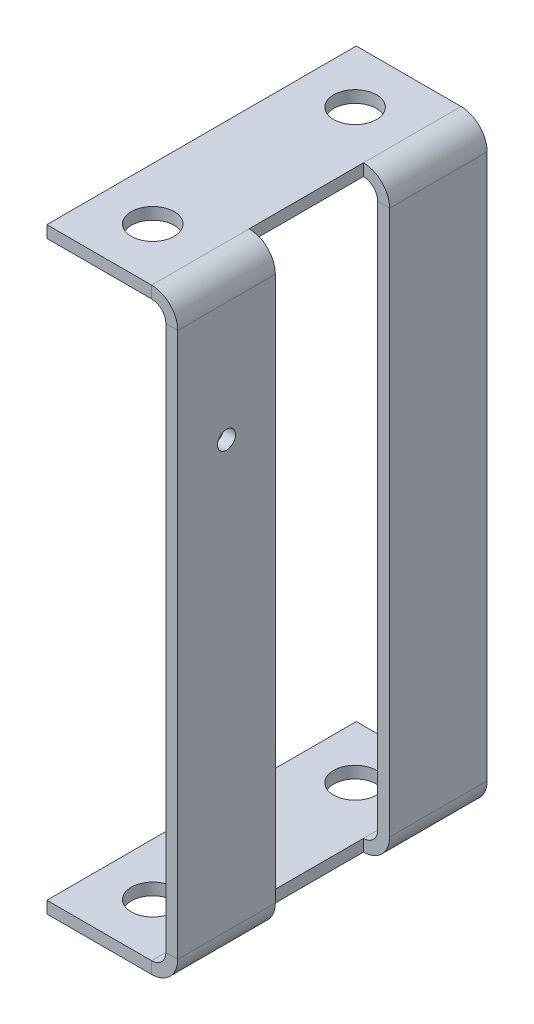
ISO-10303-21;
HEADER;
FILE_DESCRIPTION(('STEP AP214'),'2;1');
FILE_NAME('part.step','',(''),(''),'','','');
FILE_SCHEMA(('AUTOMOTIVE_DESIGN { 1 0 10303 214 1 1 1 1 }'));
ENDSEC;
DATA;
#1=APPLICATION_CONTEXT('core data for automotive mechanical design processes');
#2=APPLICATION_PROTOCOL_DEFINITION('international standard','automotive_design',2000,#1);
#3=PRODUCT_CONTEXT('',#1,'mechanical');
#4=PRODUCT('Part','Part','',(#3));
#5=PRODUCT_RELATED_PRODUCT_CATEGORY('part','',(#4));
#6=PRODUCT_DEFINITION_FORMATION('','',#4);
#7=PRODUCT_DEFINITION_CONTEXT('part definition',#1,'design');
#8=PRODUCT_DEFINITION('design','',#6,#7);
#9=PRODUCT_DEFINITION_SHAPE('','',#8);
#10=(LENGTH_UNIT() NAMED_UNIT(*) SI_UNIT(.MILLI.,.METRE.));
#11=(NAMED_UNIT(*) PLANE_ANGLE_UNIT() SI_UNIT($,.RADIAN.));
#12=(NAMED_UNIT(*) SI_UNIT($,.STERADIAN.) SOLID_ANGLE_UNIT());
#13=UNCERTAINTY_MEASURE_WITH_UNIT(LENGTH_MEASURE(1.E-05),#10,'distance_accuracy_value','');
#14=(GEOMETRIC_REPRESENTATION_CONTEXT(3) GLOBAL_UNCERTAINTY_ASSIGNED_CONTEXT((#13)) GLOBAL_UNIT_ASSIGNED_CONTEXT((#10,
#11,#12)) REPRESENTATION_CONTEXT('',''));
#15=CARTESIAN_POINT('',(0.,0.,0.));
#16=DIRECTION('',(0.,0.,1.));
#17=DIRECTION('',(1.,0.,0.));
#18=AXIS2_PLACEMENT_3D('',#15,#16,#17);
#19=CARTESIAN_POINT('',(1.39700000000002,-11.2436076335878,0.795931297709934));
#20=DIRECTION('',(0.,0.,-1.));
#21=DIRECTION('',(-1.,0.,0.));
#22=AXIS2_PLACEMENT_3D('',#19,#20,#21);
#23=PLANE('',#22);
#24=DIRECTION('',(0.,1.,0.));
#25=VECTOR('',#24,1.);
#26=CARTESIAN_POINT('',(0.,0.,0.795931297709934));
#27=LINE('',#26,#25);
#28=CARTESIAN_POINT('',(0.,-9.84660763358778,0.795931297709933));
#29=VERTEX_POINT('',#28);
#30=CARTESIAN_POINT('',(0.,19.2089923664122,0.795931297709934));
#31=VERTEX_POINT('',#30);
#32=EDGE_CURVE('E251',#29,#31,#27,.T.);
#33=ORIENTED_EDGE('',*,*,#32,.T.);
#34=DIRECTION('',(-1.,0.,0.));
#35=VECTOR('',#34,1.);
#36=CARTESIAN_POINT('',(0.,19.2089923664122,0.795931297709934));
#37=LINE('',#36,#35);
#38=CARTESIAN_POINT('',(-0.635,19.2089923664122,0.795931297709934));
#39=VERTEX_POINT('',#38);
#40=EDGE_CURVE('E15',#31,#39,#37,.T.);
#41=ORIENTED_EDGE('',*,*,#40,.T.);
#42=DIRECTION('',(0.,1.,0.));
#43=VECTOR('',#42,1.);
#44=CARTESIAN_POINT('',(-0.635,0.,0.795931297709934));
#45=LINE('',#44,#43);
#46=CARTESIAN_POINT('',(-0.634999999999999,-9.84660763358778,0.795931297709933));
#47=VERTEX_POINT('',#46);
#48=EDGE_CURVE('E411',#47,#39,#45,.T.);
#49=ORIENTED_EDGE('',*,*,#48,.F.);
#50=CARTESIAN_POINT('',(-1.397,-9.84660763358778,0.795931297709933));
#51=DIRECTION('',(0.,0.,-1.));
#52=DIRECTION('',(-1.,0.,0.));
#53=AXIS2_PLACEMENT_3D('',#50,#51,#52);
#54=CIRCLE('',#53,0.762000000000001);
#55=CARTESIAN_POINT('',(-1.397,-10.6086076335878,0.795931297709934));
#56=VERTEX_POINT('',#55);
#57=EDGE_CURVE('E99',#56,#47,#54,.F.);
#58=ORIENTED_EDGE('',*,*,#57,.F.);
#59=DIRECTION('',(0.,1.,0.));
#60=VECTOR('',#59,1.);
#61=CARTESIAN_POINT('',(-1.39700000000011,-11.2436076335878,0.795931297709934));
#62=LINE('',#61,#60);
#63=CARTESIAN_POINT('',(-1.39700000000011,-11.2436076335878,0.795931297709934));
#64=VERTEX_POINT('',#63);
#65=EDGE_CURVE('E112',#64,#56,#62,.T.);
#66=ORIENTED_EDGE('',*,*,#65,.F.);
#67=CARTESIAN_POINT('',(-1.397,-9.84660763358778,0.795931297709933));
#68=DIRECTION('',(0.,0.,-1.));
#69=DIRECTION('',(-1.,0.,0.));
#70=AXIS2_PLACEMENT_3D('',#67,#68,#69);
#71=CIRCLE('',#70,1.397);
#72=EDGE_CURVE('E227',#64,#29,#71,.F.);
#73=ORIENTED_EDGE('',*,*,#72,.T.);
#74=EDGE_LOOP('',(#33,#41,#49,#58,#66,#73));
#75=FACE_BOUND('',#74,.T.);
#76=ADVANCED_FACE('F90',(#75),#23,.F.);
#77=CARTESIAN_POINT('',(-0.635,0.,0.));
#78=DIRECTION('',(1.,0.,0.));
#79=DIRECTION('',(0.,0.,-1.));
#80=AXIS2_PLACEMENT_3D('',#77,#78,#79);
#81=PLANE('',#80);
#82=DIRECTION('',(0.,0.,1.));
#83=VECTOR('',#82,1.);
#84=CARTESIAN_POINT('',(-0.634999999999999,-9.84660763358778,12.0989312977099));
#85=LINE('',#84,#83);
#86=CARTESIAN_POINT('',(-0.634999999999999,-9.84660763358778,-4.41106870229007));
#87=VERTEX_POINT('',#86);
#88=EDGE_CURVE('E291',#47,#87,#85,.F.);
#89=ORIENTED_EDGE('',*,*,#88,.F.);
#90=ORIENTED_EDGE('',*,*,#48,.T.);
#91=DIRECTION('',(0.,0.,-1.));
#92=VECTOR('',#91,1.);
#93=CARTESIAN_POINT('',(-0.635000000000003,19.2089923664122,-4.41106870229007));
#94=LINE('',#93,#92);
#95=CARTESIAN_POINT('',(-0.635000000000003,19.2089923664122,-4.41106870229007));
#96=VERTEX_POINT('',#95);
#97=EDGE_CURVE('E350',#96,#39,#94,.F.);
#98=ORIENTED_EDGE('',*,*,#97,.F.);
#99=DIRECTION('',(0.,1.,0.));
#100=VECTOR('',#99,1.);
#101=CARTESIAN_POINT('',(-0.635,20.6059923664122,-4.41106870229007));
#102=LINE('',#101,#100);
#103=EDGE_CURVE('E365',#87,#96,#102,.T.);
#104=ORIENTED_EDGE('',*,*,#103,.F.);
#105=EDGE_LOOP('',(#89,#90,#98,#104));
#106=FACE_BOUND('',#105,.T.);
#107=ADVANCED_FACE('F517',(#106),#81,.F.);
#108=CARTESIAN_POINT('',(0.,0.,0.));
#109=DIRECTION('',(1.,0.,0.));
#110=DIRECTION('',(0.,0.,-1.));
#111=AXIS2_PLACEMENT_3D('',#108,#109,#110);
#112=PLANE('',#111);
#113=ORIENTED_EDGE('',*,*,#32,.F.);
#114=DIRECTION('',(0.,0.,1.));
#115=VECTOR('',#114,1.);
#116=CARTESIAN_POINT('',(0.,-9.84660763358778,12.0989312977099));
#117=LINE('',#116,#115);
#118=CARTESIAN_POINT('',(0.,-9.84660763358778,-4.41106870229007));
#119=VERTEX_POINT('',#118);
#120=EDGE_CURVE('E250',#29,#119,#117,.F.);
#121=ORIENTED_EDGE('',*,*,#120,.T.);
#122=DIRECTION('',(0.,1.,0.));
#123=VECTOR('',#122,1.);
#124=CARTESIAN_POINT('',(0.,20.6059923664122,-4.41106870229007));
#125=LINE('',#124,#123);
#126=CARTESIAN_POINT('',(0.,19.2089923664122,-4.41106870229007));
#127=VERTEX_POINT('',#126);
#128=EDGE_CURVE('E366',#119,#127,#125,.T.);
#129=ORIENTED_EDGE('',*,*,#128,.T.);
#130=DIRECTION('',(0.,0.,-1.));
#131=VECTOR('',#130,1.);
#132=CARTESIAN_POINT('',(0.,19.2089923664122,-4.41106870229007));
#133=LINE('',#132,#131);
#134=EDGE_CURVE('E336',#127,#31,#133,.F.);
#135=ORIENTED_EDGE('',*,*,#134,.T.);
#136=EDGE_LOOP('',(#113,#121,#129,#135));
#137=FACE_BOUND('',#136,.T.);
#138=ADVANCED_FACE('F501',(#137),#112,.T.);
#139=CARTESIAN_POINT('',(-1.397,19.2089923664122,-4.41106870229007));
#140=DIRECTION('',(0.,0.,-1.));
#141=DIRECTION('',(0.,1.,0.));
#142=AXIS2_PLACEMENT_3D('',#139,#140,#141);
#143=CYLINDRICAL_SURFACE('',#142,1.397);
#144=CARTESIAN_POINT('',(-1.397,19.2089923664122,0.795931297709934));
#145=DIRECTION('',(0.,0.,-1.));
#146=DIRECTION('',(-1.,0.,0.));
#147=AXIS2_PLACEMENT_3D('',#144,#145,#146);
#148=CIRCLE('',#147,1.397);
#149=CARTESIAN_POINT('',(-1.397,20.6059923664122,0.795931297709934));
#150=VERTEX_POINT('',#149);
#151=EDGE_CURVE('E275',#31,#150,#148,.F.);
#152=ORIENTED_EDGE('',*,*,#151,.F.);
#153=ORIENTED_EDGE('',*,*,#134,.F.);
#154=CARTESIAN_POINT('',(-1.397,19.2089923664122,-4.41106870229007));
#155=DIRECTION('',(0.,0.,-1.));
#156=DIRECTION('',(-1.,0.,0.));
#157=AXIS2_PLACEMENT_3D('',#154,#155,#156);
#158=CIRCLE('',#157,1.397);
#159=CARTESIAN_POINT('',(-1.397,20.6059923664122,-4.41106870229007));
#160=VERTEX_POINT('',#159);
#161=EDGE_CURVE('E344',#160,#127,#158,.T.);
#162=ORIENTED_EDGE('',*,*,#161,.F.);
#163=DIRECTION('',(0.,0.,-1.));
#164=VECTOR('',#163,1.);
#165=CARTESIAN_POINT('',(-1.397,20.6059923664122,12.0989312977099));
#166=LINE('',#165,#164);
#167=EDGE_CURVE('E323',#160,#150,#166,.F.);
#168=ORIENTED_EDGE('',*,*,#167,.T.);
#169=EDGE_LOOP('',(#152,#153,#162,#168));
#170=FACE_BOUND('',#169,.T.);
#171=ADVANCED_FACE('F499',(#170),#143,.T.);
#172=CARTESIAN_POINT('',(-1.397,19.2089923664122,-4.41106870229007));
#173=DIRECTION('',(0.,0.,-1.));
#174=DIRECTION('',(0.,1.,0.));
#175=AXIS2_PLACEMENT_3D('',#172,#173,#174);
#176=CYLINDRICAL_SURFACE('',#175,0.761999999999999);
#177=ORIENTED_EDGE('',*,*,#97,.T.);
#178=CARTESIAN_POINT('',(-1.397,19.2089923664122,0.795931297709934));
#179=DIRECTION('',(0.,0.,-1.));
#180=DIRECTION('',(-1.,0.,0.));
#181=AXIS2_PLACEMENT_3D('',#178,#179,#180);
#182=CIRCLE('',#181,0.761999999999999);
#183=CARTESIAN_POINT('',(-1.397,19.9709923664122,0.795931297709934));
#184=VERTEX_POINT('',#183);
#185=EDGE_CURVE('E252',#39,#184,#182,.F.);
#186=ORIENTED_EDGE('',*,*,#185,.T.);
#187=DIRECTION('',(0.,0.,-1.));
#188=VECTOR('',#187,1.);
#189=CARTESIAN_POINT('',(-1.397,19.9709923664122,12.0989312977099));
#190=LINE('',#189,#188);
#191=CARTESIAN_POINT('',(-1.397,19.9709923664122,-4.41106870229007));
#192=VERTEX_POINT('',#191);
#193=EDGE_CURVE('E333',#184,#192,#190,.T.);
#194=ORIENTED_EDGE('',*,*,#193,.T.);
#195=CARTESIAN_POINT('',(-1.397,19.2089923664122,-4.41106870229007));
#196=DIRECTION('',(0.,0.,-1.));
#197=DIRECTION('',(-1.,0.,0.));
#198=AXIS2_PLACEMENT_3D('',#195,#196,#197);
#199=CIRCLE('',#198,0.761999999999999);
#200=EDGE_CURVE('E305',#192,#96,#199,.T.);
#201=ORIENTED_EDGE('',*,*,#200,.T.);
#202=EDGE_LOOP('',(#177,#186,#194,#201));
#203=FACE_BOUND('',#202,.T.);
#204=ADVANCED_FACE('F509',(#203),#176,.F.);
#205=CARTESIAN_POINT('',(-1.397,-9.84660763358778,12.0989312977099));
#206=DIRECTION('',(0.,0.,1.));
#207=DIRECTION('',(0.,-1.,0.));
#208=AXIS2_PLACEMENT_3D('',#205,#206,#207);
#209=CYLINDRICAL_SURFACE('',#208,1.397);
#210=ORIENTED_EDGE('',*,*,#72,.F.);
#211=DIRECTION('',(0.,0.,1.));
#212=VECTOR('',#211,1.);
#213=CARTESIAN_POINT('',(-1.397,-11.2436076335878,-4.41106870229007));
#214=LINE('',#213,#212);
#215=CARTESIAN_POINT('',(-1.39699999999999,-11.2436076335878,-4.41106870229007));
#216=VERTEX_POINT('',#215);
#217=EDGE_CURVE('E248',#64,#216,#214,.F.);
#218=ORIENTED_EDGE('',*,*,#217,.T.);
#219=CARTESIAN_POINT('',(-1.397,-9.84660763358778,-4.41106870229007));
#220=DIRECTION('',(0.,0.,1.));
#221=DIRECTION('',(1.,0.,0.));
#222=AXIS2_PLACEMENT_3D('',#219,#220,#221);
#223=CIRCLE('',#222,1.397);
#224=EDGE_CURVE('E279',#119,#216,#223,.F.);
#225=ORIENTED_EDGE('',*,*,#224,.F.);
#226=ORIENTED_EDGE('',*,*,#120,.F.);
#227=EDGE_LOOP('',(#210,#218,#225,#226));
#228=FACE_BOUND('',#227,.T.);
#229=ADVANCED_FACE('F246',(#228),#209,.T.);
#230=CARTESIAN_POINT('',(-1.397,-9.84660763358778,12.0989312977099));
#231=DIRECTION('',(0.,0.,1.));
#232=DIRECTION('',(0.,-1.,0.));
#233=AXIS2_PLACEMENT_3D('',#230,#231,#232);
#234=CYLINDRICAL_SURFACE('',#233,0.762000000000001);
#235=DIRECTION('',(0.,0.,1.));
#236=VECTOR('',#235,1.);
#237=CARTESIAN_POINT('',(-1.397,-10.6086076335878,-4.41106870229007));
#238=LINE('',#237,#236);
#239=CARTESIAN_POINT('',(-1.397,-10.6086076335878,-4.41106870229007));
#240=VERTEX_POINT('',#239);
#241=EDGE_CURVE('E263',#240,#56,#238,.T.);
#242=ORIENTED_EDGE('',*,*,#241,.T.);
#243=ORIENTED_EDGE('',*,*,#57,.T.);
#244=ORIENTED_EDGE('',*,*,#88,.T.);
#245=CARTESIAN_POINT('',(-1.397,-9.84660763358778,-4.41106870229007));
#246=DIRECTION('',(0.,0.,1.));
#247=DIRECTION('',(1.,0.,0.));
#248=AXIS2_PLACEMENT_3D('',#245,#246,#247);
#249=CIRCLE('',#248,0.762000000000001);
#250=EDGE_CURVE('E285',#87,#240,#249,.F.);
#251=ORIENTED_EDGE('',*,*,#250,.T.);
#252=EDGE_LOOP('',(#242,#243,#244,#251));
#253=FACE_BOUND('',#252,.T.);
#254=ADVANCED_FACE('F519',(#253),#234,.F.);
#255=CARTESIAN_POINT('',(-0.635,12.8589923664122,9.49543129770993));
#256=DIRECTION('',(1.,0.,0.));
#257=DIRECTION('',(0.,0.,-1.));
#258=AXIS2_PLACEMENT_3D('',#255,#256,#257);
#259=CIRCLE('',#258,0.482599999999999);
#260=CARTESIAN_POINT('',(-0.635,12.8589923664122,9.01283129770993));
#261=VERTEX_POINT('',#260);
#262=EDGE_CURVE('E635',#261,#261,#259,.T.);
#263=ORIENTED_EDGE('',*,*,#262,.T.);
#264=EDGE_LOOP('',(#263));
#265=FACE_BOUND('',#264,.T.);
#266=CARTESIAN_POINT('',(-0.635,19.2089923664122,6.89193129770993));
#267=VERTEX_POINT('',#266);
#268=CARTESIAN_POINT('',(-0.635000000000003,19.2089923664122,12.0989312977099));
#269=VERTEX_POINT('',#268);
#270=EDGE_CURVE('E353',#267,#269,#94,.F.);
#271=ORIENTED_EDGE('',*,*,#270,.F.);
#272=DIRECTION('',(0.,-1.,0.));
#273=VECTOR('',#272,1.);
#274=CARTESIAN_POINT('',(-0.635,0.,6.89193129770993));
#275=LINE('',#274,#273);
#276=CARTESIAN_POINT('',(-0.634999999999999,-9.84660763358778,6.89193129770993));
#277=VERTEX_POINT('',#276);
#278=EDGE_CURVE('E399',#267,#277,#275,.T.);
#279=ORIENTED_EDGE('',*,*,#278,.T.);
#280=CARTESIAN_POINT('',(-0.634999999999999,-9.84660763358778,12.0989312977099));
#281=VERTEX_POINT('',#280);
#282=EDGE_CURVE('E288',#281,#277,#85,.F.);
#283=ORIENTED_EDGE('',*,*,#282,.F.);
#284=DIRECTION('',(0.,-1.,0.));
#285=VECTOR('',#284,1.);
#286=CARTESIAN_POINT('',(-0.635,20.6059923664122,12.0989312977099));
#287=LINE('',#286,#285);
#288=EDGE_CURVE('E362',#269,#281,#287,.T.);
#289=ORIENTED_EDGE('',*,*,#288,.F.);
#290=EDGE_LOOP('',(#271,#279,#283,#289));
#291=FACE_BOUND('',#290,.T.);
#292=ADVANCED_FACE('F459',(#265,#291),#81,.F.);
#293=CARTESIAN_POINT('',(0.,12.8589923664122,9.49543129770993));
#294=DIRECTION('',(1.,0.,0.));
#295=DIRECTION('',(0.,0.,-1.));
#296=AXIS2_PLACEMENT_3D('',#293,#294,#295);
#297=CIRCLE('',#296,0.482599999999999);
#298=CARTESIAN_POINT('',(0.,12.8589923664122,9.01283129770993));
#299=VERTEX_POINT('',#298);
#300=EDGE_CURVE('E632',#299,#299,#297,.T.);
#301=ORIENTED_EDGE('',*,*,#300,.F.);
#302=EDGE_LOOP('',(#301));
#303=FACE_BOUND('',#302,.T.);
#304=DIRECTION('',(0.,-1.,0.));
#305=VECTOR('',#304,1.);
#306=CARTESIAN_POINT('',(0.,0.,6.89193129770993));
#307=LINE('',#306,#305);
#308=CARTESIAN_POINT('',(0.,19.2089923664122,6.89193129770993));
#309=VERTEX_POINT('',#308);
#310=CARTESIAN_POINT('',(0.,-9.84660763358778,6.89193129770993));
#311=VERTEX_POINT('',#310);
#312=EDGE_CURVE('E407',#309,#311,#307,.T.);
#313=ORIENTED_EDGE('',*,*,#312,.F.);
#314=CARTESIAN_POINT('',(0.,19.2089923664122,12.0989312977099));
#315=VERTEX_POINT('',#314);
#316=EDGE_CURVE('E340',#309,#315,#133,.F.);
#317=ORIENTED_EDGE('',*,*,#316,.T.);
#318=DIRECTION('',(0.,-1.,0.));
#319=VECTOR('',#318,1.);
#320=CARTESIAN_POINT('',(0.,20.6059923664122,12.0989312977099));
#321=LINE('',#320,#319);
#322=CARTESIAN_POINT('',(0.,-9.84660763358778,12.0989312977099));
#323=VERTEX_POINT('',#322);
#324=EDGE_CURVE('E359',#315,#323,#321,.T.);
#325=ORIENTED_EDGE('',*,*,#324,.T.);
#326=EDGE_CURVE('E276',#323,#311,#117,.F.);
#327=ORIENTED_EDGE('',*,*,#326,.T.);
#328=EDGE_LOOP('',(#313,#317,#325,#327));
#329=FACE_BOUND('',#328,.T.);
#330=ADVANCED_FACE('F569',(#303,#329),#112,.T.);
#331=CARTESIAN_POINT('',(-0.635,20.6059923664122,12.0989312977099));
#332=DIRECTION('',(0.,0.,1.));
#333=DIRECTION('',(0.,-1.,0.));
#334=AXIS2_PLACEMENT_3D('',#331,#332,#333);
#335=PLANE('',#334);
#336=ORIENTED_EDGE('',*,*,#288,.T.);
#337=DIRECTION('',(1.,0.,0.));
#338=VECTOR('',#337,1.);
#339=CARTESIAN_POINT('',(-0.634999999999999,-9.84660763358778,12.0989312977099));
#340=LINE('',#339,#338);
#341=EDGE_CURVE('E281',#281,#323,#340,.T.);
#342=ORIENTED_EDGE('',*,*,#341,.T.);
#343=ORIENTED_EDGE('',*,*,#324,.F.);
#344=DIRECTION('',(1.,0.,0.));
#345=VECTOR('',#344,1.);
#346=CARTESIAN_POINT('',(-0.635000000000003,19.2089923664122,12.0989312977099));
#347=LINE('',#346,#345);
#348=EDGE_CURVE('E356',#269,#315,#347,.T.);
#349=ORIENTED_EDGE('',*,*,#348,.F.);
#350=EDGE_LOOP('',(#336,#342,#343,#349));
#351=FACE_BOUND('',#350,.T.);
#352=ADVANCED_FACE('F92',(#351),#335,.T.);
#353=CARTESIAN_POINT('',(-0.635,20.6059923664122,-4.41106870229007));
#354=DIRECTION('',(0.,0.,-1.));
#355=DIRECTION('',(0.,1.,0.));
#356=AXIS2_PLACEMENT_3D('',#353,#354,#355);
#357=PLANE('',#356);
#358=DIRECTION('',(1.,0.,0.));
#359=VECTOR('',#358,1.);
#360=CARTESIAN_POINT('',(-0.634999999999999,-9.84660763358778,-4.41106870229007));
#361=LINE('',#360,#359);
#362=EDGE_CURVE('E296',#87,#119,#361,.T.);
#363=ORIENTED_EDGE('',*,*,#362,.F.);
#364=ORIENTED_EDGE('',*,*,#103,.T.);
#365=DIRECTION('',(1.,0.,0.));
#366=VECTOR('',#365,1.);
#367=CARTESIAN_POINT('',(-0.635000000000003,19.2089923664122,-4.41106870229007));
#368=LINE('',#367,#366);
#369=EDGE_CURVE('E343',#96,#127,#368,.T.);
#370=ORIENTED_EDGE('',*,*,#369,.T.);
#371=ORIENTED_EDGE('',*,*,#128,.F.);
#372=EDGE_LOOP('',(#363,#364,#370,#371));
#373=FACE_BOUND('',#372,.T.);
#374=ADVANCED_FACE('F505',(#373),#357,.T.);
#375=CARTESIAN_POINT('',(-1.397,19.2089923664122,12.0989312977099));
#376=DIRECTION('',(0.,0.,1.));
#377=DIRECTION('',(1.,0.,0.));
#378=AXIS2_PLACEMENT_3D('',#375,#376,#377);
#379=PLANE('',#378);
#380=DIRECTION('',(0.,-1.,0.));
#381=VECTOR('',#380,1.);
#382=CARTESIAN_POINT('',(-1.397,20.6059923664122,12.0989312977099));
#383=LINE('',#382,#381);
#384=CARTESIAN_POINT('',(-1.397,19.9709923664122,12.0989312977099));
#385=VERTEX_POINT('',#384);
#386=CARTESIAN_POINT('',(-1.397,20.6059923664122,12.0989312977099));
#387=VERTEX_POINT('',#386);
#388=EDGE_CURVE('E299',#385,#387,#383,.F.);
#389=ORIENTED_EDGE('',*,*,#388,.F.);
#390=CARTESIAN_POINT('',(-1.397,19.2089923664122,12.0989312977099));
#391=DIRECTION('',(0.,0.,-1.));
#392=DIRECTION('',(-1.,0.,0.));
#393=AXIS2_PLACEMENT_3D('',#390,#391,#392);
#394=CIRCLE('',#393,0.761999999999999);
#395=EDGE_CURVE('E347',#269,#385,#394,.F.);
#396=ORIENTED_EDGE('',*,*,#395,.F.);
#397=ORIENTED_EDGE('',*,*,#348,.T.);
#398=CARTESIAN_POINT('',(-1.397,19.2089923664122,12.0989312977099));
#399=DIRECTION('',(0.,0.,-1.));
#400=DIRECTION('',(-1.,0.,0.));
#401=AXIS2_PLACEMENT_3D('',#398,#399,#400);
#402=CIRCLE('',#401,1.397);
#403=EDGE_CURVE('E339',#315,#387,#402,.F.);
#404=ORIENTED_EDGE('',*,*,#403,.T.);
#405=EDGE_LOOP('',(#389,#396,#397,#404));
#406=FACE_BOUND('',#405,.T.);
#407=ADVANCED_FACE('F465',(#406),#379,.T.);
#408=CARTESIAN_POINT('',(-1.397,19.2089923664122,-4.41106870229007));
#409=DIRECTION('',(0.,0.,1.));
#410=DIRECTION('',(1.,0.,0.));
#411=AXIS2_PLACEMENT_3D('',#408,#409,#410);
#412=PLANE('',#411);
#413=ORIENTED_EDGE('',*,*,#200,.F.);
#414=DIRECTION('',(0.,-1.,0.));
#415=VECTOR('',#414,1.);
#416=CARTESIAN_POINT('',(-1.397,19.9709923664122,-4.41106870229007));
#417=LINE('',#416,#415);
#418=EDGE_CURVE('E327',#192,#160,#417,.F.);
#419=ORIENTED_EDGE('',*,*,#418,.T.);
#420=ORIENTED_EDGE('',*,*,#161,.T.);
#421=ORIENTED_EDGE('',*,*,#369,.F.);
#422=EDGE_LOOP('',(#413,#419,#420,#421));
#423=FACE_BOUND('',#422,.T.);
#424=ADVANCED_FACE('F492',(#423),#412,.F.);
#425=CARTESIAN_POINT('',(-1.397,19.2089923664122,6.89193129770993));
#426=DIRECTION('',(0.,0.,1.));
#427=DIRECTION('',(1.,0.,0.));
#428=AXIS2_PLACEMENT_3D('',#425,#426,#427);
#429=CIRCLE('',#428,1.397);
#430=CARTESIAN_POINT('',(-1.397,20.6059923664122,6.89193129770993));
#431=VERTEX_POINT('',#430);
#432=EDGE_CURVE('E409',#431,#309,#429,.F.);
#433=ORIENTED_EDGE('',*,*,#432,.F.);
#434=EDGE_CURVE('E326',#431,#387,#166,.F.);
#435=ORIENTED_EDGE('',*,*,#434,.T.);
#436=ORIENTED_EDGE('',*,*,#403,.F.);
#437=ORIENTED_EDGE('',*,*,#316,.F.);
#438=EDGE_LOOP('',(#433,#435,#436,#437));
#439=FACE_BOUND('',#438,.T.);
#440=ADVANCED_FACE('F579',(#439),#143,.T.);
#441=CARTESIAN_POINT('',(-1.397,19.9709923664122,6.89193129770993));
#442=VERTEX_POINT('',#441);
#443=EDGE_CURVE('E330',#385,#442,#190,.T.);
#444=ORIENTED_EDGE('',*,*,#443,.T.);
#445=CARTESIAN_POINT('',(-1.397,19.2089923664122,6.89193129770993));
#446=DIRECTION('',(0.,0.,1.));
#447=DIRECTION('',(1.,0.,0.));
#448=AXIS2_PLACEMENT_3D('',#445,#446,#447);
#449=CIRCLE('',#448,0.761999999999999);
#450=EDGE_CURVE('E402',#442,#267,#449,.F.);
#451=ORIENTED_EDGE('',*,*,#450,.T.);
#452=ORIENTED_EDGE('',*,*,#270,.T.);
#453=ORIENTED_EDGE('',*,*,#395,.T.);
#454=EDGE_LOOP('',(#444,#451,#452,#453));
#455=FACE_BOUND('',#454,.T.);
#456=ADVANCED_FACE('F469',(#455),#176,.F.);
#457=CARTESIAN_POINT('',(-6.985,20.6059923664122,-4.41106870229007));
#458=DIRECTION('',(0.,0.,1.));
#459=DIRECTION('',(1.,0.,0.));
#460=AXIS2_PLACEMENT_3D('',#457,#458,#459);
#461=PLANE('',#460);
#462=ORIENTED_EDGE('',*,*,#418,.F.);
#463=DIRECTION('',(1.,0.,0.));
#464=VECTOR('',#463,1.);
#465=CARTESIAN_POINT('',(-6.985,19.9709923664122,-4.41106870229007));
#466=LINE('',#465,#464);
#467=CARTESIAN_POINT('',(-6.985,19.9709923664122,-4.41106870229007));
#468=VERTEX_POINT('',#467);
#469=EDGE_CURVE('E321',#192,#468,#466,.F.);
#470=ORIENTED_EDGE('',*,*,#469,.T.);
#471=DIRECTION('',(0.,-1.,0.));
#472=VECTOR('',#471,1.);
#473=CARTESIAN_POINT('',(-6.985,20.6059923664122,-4.41106870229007));
#474=LINE('',#473,#472);
#475=CARTESIAN_POINT('',(-6.985,20.6059923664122,-4.41106870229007));
#476=VERTEX_POINT('',#475);
#477=EDGE_CURVE('E302',#476,#468,#474,.T.);
#478=ORIENTED_EDGE('',*,*,#477,.F.);
#479=DIRECTION('',(-1.,0.,0.));
#480=VECTOR('',#479,1.);
#481=CARTESIAN_POINT('',(0.,20.6059923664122,-4.41106870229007));
#482=LINE('',#481,#480);
#483=EDGE_CURVE('E314',#160,#476,#482,.T.);
#484=ORIENTED_EDGE('',*,*,#483,.F.);
#485=EDGE_LOOP('',(#462,#470,#478,#484));
#486=FACE_BOUND('',#485,.T.);
#487=ADVANCED_FACE('F487',(#486),#461,.F.);
#488=CARTESIAN_POINT('',(-0.634999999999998,20.6059923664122,12.0989312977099));
#489=DIRECTION('',(0.,0.,-1.));
#490=DIRECTION('',(-1.,0.,0.));
#491=AXIS2_PLACEMENT_3D('',#488,#489,#490);
#492=PLANE('',#491);
#493=ORIENTED_EDGE('',*,*,#388,.T.);
#494=DIRECTION('',(1.,0.,0.));
#495=VECTOR('',#494,1.);
#496=CARTESIAN_POINT('',(0.,20.6059923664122,12.0989312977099));
#497=LINE('',#496,#495);
#498=CARTESIAN_POINT('',(-6.985,20.6059923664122,12.0989312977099));
#499=VERTEX_POINT('',#498);
#500=EDGE_CURVE('E309',#499,#387,#497,.T.);
#501=ORIENTED_EDGE('',*,*,#500,.F.);
#502=DIRECTION('',(0.,-1.,0.));
#503=VECTOR('',#502,1.);
#504=CARTESIAN_POINT('',(-6.985,20.6059923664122,12.0989312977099));
#505=LINE('',#504,#503);
#506=CARTESIAN_POINT('',(-6.985,19.9709923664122,12.0989312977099));
#507=VERTEX_POINT('',#506);
#508=EDGE_CURVE('E306',#499,#507,#505,.T.);
#509=ORIENTED_EDGE('',*,*,#508,.T.);
#510=DIRECTION('',(-1.,0.,0.));
#511=VECTOR('',#510,1.);
#512=CARTESIAN_POINT('',(-0.635,19.9709923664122,12.0989312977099));
#513=LINE('',#512,#511);
#514=EDGE_CURVE('E316',#507,#385,#513,.F.);
#515=ORIENTED_EDGE('',*,*,#514,.T.);
#516=EDGE_LOOP('',(#493,#501,#509,#515));
#517=FACE_BOUND('',#516,.T.);
#518=ADVANCED_FACE('F478',(#517),#492,.F.);
#519=CARTESIAN_POINT('',(0.,20.6059923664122,0.));
#520=DIRECTION('',(0.,-1.,0.));
#521=DIRECTION('',(1.,0.,0.));
#522=AXIS2_PLACEMENT_3D('',#519,#520,#521);
#523=PLANE('',#522);
#524=CARTESIAN_POINT('',(-4.19099999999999,20.6059923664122,9.24143129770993));
#525=DIRECTION('',(0.,1.,0.));
#526=DIRECTION('',(-1.,0.,0.));
#527=AXIS2_PLACEMENT_3D('',#524,#525,#526);
#528=CIRCLE('',#527,1.143);
#529=CARTESIAN_POINT('',(-5.33399999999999,20.6059923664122,9.24143129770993));
#530=VERTEX_POINT('',#529);
#531=EDGE_CURVE('E606',#530,#530,#528,.T.);
#532=ORIENTED_EDGE('',*,*,#531,.F.);
#533=EDGE_LOOP('',(#532));
#534=FACE_BOUND('',#533,.T.);
#535=CARTESIAN_POINT('',(-4.19099999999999,20.6059923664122,-1.55356870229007));
#536=DIRECTION('',(0.,1.,0.));
#537=DIRECTION('',(-1.,0.,0.));
#538=AXIS2_PLACEMENT_3D('',#535,#536,#537);
#539=CIRCLE('',#538,1.143);
#540=CARTESIAN_POINT('',(-5.33399999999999,20.6059923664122,-1.55356870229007));
#541=VERTEX_POINT('',#540);
#542=EDGE_CURVE('E385',#541,#541,#539,.T.);
#543=ORIENTED_EDGE('',*,*,#542,.F.);
#544=EDGE_LOOP('',(#543));
#545=FACE_BOUND('',#544,.T.);
#546=ORIENTED_EDGE('',*,*,#167,.F.);
#547=ORIENTED_EDGE('',*,*,#483,.T.);
#548=DIRECTION('',(0.,0.,1.));
#549=VECTOR('',#548,1.);
#550=CARTESIAN_POINT('',(-6.985,20.6059923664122,0.));
#551=LINE('',#550,#549);
#552=EDGE_CURVE('E312',#476,#499,#551,.T.);
#553=ORIENTED_EDGE('',*,*,#552,.T.);
#554=ORIENTED_EDGE('',*,*,#500,.T.);
#555=ORIENTED_EDGE('',*,*,#434,.F.);
#556=DIRECTION('',(0.,0.,1.));
#557=VECTOR('',#556,1.);
#558=CARTESIAN_POINT('',(-1.397,20.6059923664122,6.89193129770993));
#559=LINE('',#558,#557);
#560=EDGE_CURVE('E242',#150,#431,#559,.T.);
#561=ORIENTED_EDGE('',*,*,#560,.F.);
#562=EDGE_LOOP('',(#546,#547,#553,#554,#555,#561));
#563=FACE_BOUND('',#562,.T.);
#564=ADVANCED_FACE('F495',(#534,#545,#563),#523,.F.);
#565=CARTESIAN_POINT('',(0.,19.9709923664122,0.));
#566=DIRECTION('',(0.,-1.,0.));
#567=DIRECTION('',(1.,0.,0.));
#568=AXIS2_PLACEMENT_3D('',#565,#566,#567);
#569=PLANE('',#568);
#570=CARTESIAN_POINT('',(-4.191,19.9709923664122,9.24143129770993));
#571=DIRECTION('',(0.,-1.,0.));
#572=DIRECTION('',(1.,0.,0.));
#573=AXIS2_PLACEMENT_3D('',#570,#571,#572);
#574=CIRCLE('',#573,1.143);
#575=CARTESIAN_POINT('',(-3.048,19.9709923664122,9.24143129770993));
#576=VERTEX_POINT('',#575);
#577=EDGE_CURVE('E390',#576,#576,#574,.T.);
#578=ORIENTED_EDGE('',*,*,#577,.F.);
#579=EDGE_LOOP('',(#578));
#580=FACE_BOUND('',#579,.T.);
#581=CARTESIAN_POINT('',(-4.191,19.9709923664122,-1.55356870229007));
#582=DIRECTION('',(0.,-1.,0.));
#583=DIRECTION('',(1.,0.,0.));
#584=AXIS2_PLACEMENT_3D('',#581,#582,#583);
#585=CIRCLE('',#584,1.143);
#586=CARTESIAN_POINT('',(-3.048,19.9709923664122,-1.55356870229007));
#587=VERTEX_POINT('',#586);
#588=EDGE_CURVE('E378',#587,#587,#585,.T.);
#589=ORIENTED_EDGE('',*,*,#588,.F.);
#590=EDGE_LOOP('',(#589));
#591=FACE_BOUND('',#590,.T.);
#592=ORIENTED_EDGE('',*,*,#469,.F.);
#593=ORIENTED_EDGE('',*,*,#193,.F.);
#594=DIRECTION('',(0.,0.,-1.));
#595=VECTOR('',#594,1.);
#596=CARTESIAN_POINT('',(-1.397,19.9709923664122,0.));
#597=LINE('',#596,#595);
#598=EDGE_CURVE('E231',#442,#184,#597,.T.);
#599=ORIENTED_EDGE('',*,*,#598,.F.);
#600=ORIENTED_EDGE('',*,*,#443,.F.);
#601=ORIENTED_EDGE('',*,*,#514,.F.);
#602=DIRECTION('',(0.,0.,-1.));
#603=VECTOR('',#602,1.);
#604=CARTESIAN_POINT('',(-6.985,19.9709923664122,12.0989312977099));
#605=LINE('',#604,#603);
#606=EDGE_CURVE('E319',#468,#507,#605,.F.);
#607=ORIENTED_EDGE('',*,*,#606,.F.);
#608=EDGE_LOOP('',(#592,#593,#599,#600,#601,#607));
#609=FACE_BOUND('',#608,.T.);
#610=ADVANCED_FACE('F474',(#580,#591,#609),#569,.T.);
#611=CARTESIAN_POINT('',(-6.985,20.6059923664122,12.0989312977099));
#612=DIRECTION('',(1.,0.,0.));
#613=DIRECTION('',(0.,1.,0.));
#614=AXIS2_PLACEMENT_3D('',#611,#612,#613);
#615=PLANE('',#614);
#616=ORIENTED_EDGE('',*,*,#606,.T.);
#617=ORIENTED_EDGE('',*,*,#508,.F.);
#618=ORIENTED_EDGE('',*,*,#552,.F.);
#619=ORIENTED_EDGE('',*,*,#477,.T.);
#620=EDGE_LOOP('',(#616,#617,#618,#619));
#621=FACE_BOUND('',#620,.T.);
#622=ADVANCED_FACE('F483',(#621),#615,.F.);
#623=CARTESIAN_POINT('',(-1.397,-9.84660763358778,-4.41106870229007));
#624=DIRECTION('',(0.,0.,-1.));
#625=DIRECTION('',(-1.,0.,0.));
#626=AXIS2_PLACEMENT_3D('',#623,#624,#625);
#627=PLANE('',#626);
#628=DIRECTION('',(0.,1.,0.));
#629=VECTOR('',#628,1.);
#630=CARTESIAN_POINT('',(-1.397,-11.2436076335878,-4.41106870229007));
#631=LINE('',#630,#629);
#632=EDGE_CURVE('E272',#240,#216,#631,.F.);
#633=ORIENTED_EDGE('',*,*,#632,.F.);
#634=ORIENTED_EDGE('',*,*,#250,.F.);
#635=ORIENTED_EDGE('',*,*,#362,.T.);
#636=ORIENTED_EDGE('',*,*,#224,.T.);
#637=EDGE_LOOP('',(#633,#634,#635,#636));
#638=FACE_BOUND('',#637,.T.);
#639=ADVANCED_FACE('F524',(#638),#627,.T.);
#640=CARTESIAN_POINT('',(-1.397,-9.84660763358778,12.0989312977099));
#641=DIRECTION('',(0.,0.,-1.));
#642=DIRECTION('',(-1.,0.,0.));
#643=AXIS2_PLACEMENT_3D('',#640,#641,#642);
#644=PLANE('',#643);
#645=CARTESIAN_POINT('',(-1.397,-9.84660763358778,12.0989312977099));
#646=DIRECTION('',(0.,0.,1.));
#647=DIRECTION('',(1.,0.,0.));
#648=AXIS2_PLACEMENT_3D('',#645,#646,#647);
#649=CIRCLE('',#648,0.762000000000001);
#650=CARTESIAN_POINT('',(-1.397,-10.6086076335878,12.0989312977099));
#651=VERTEX_POINT('',#650);
#652=EDGE_CURVE('E292',#651,#281,#649,.T.);
#653=ORIENTED_EDGE('',*,*,#652,.F.);
#654=DIRECTION('',(0.,1.,0.));
#655=VECTOR('',#654,1.);
#656=CARTESIAN_POINT('',(-1.397,-10.6086076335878,12.0989312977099));
#657=LINE('',#656,#655);
#658=CARTESIAN_POINT('',(-1.397,-11.2436076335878,12.0989312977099));
#659=VERTEX_POINT('',#658);
#660=EDGE_CURVE('E259',#651,#659,#657,.F.);
#661=ORIENTED_EDGE('',*,*,#660,.T.);
#662=CARTESIAN_POINT('',(-1.397,-9.84660763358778,12.0989312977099));
#663=DIRECTION('',(0.,0.,1.));
#664=DIRECTION('',(1.,0.,0.));
#665=AXIS2_PLACEMENT_3D('',#662,#663,#664);
#666=CIRCLE('',#665,1.397);
#667=EDGE_CURVE('E282',#659,#323,#666,.T.);
#668=ORIENTED_EDGE('',*,*,#667,.T.);
#669=ORIENTED_EDGE('',*,*,#341,.F.);
#670=EDGE_LOOP('',(#653,#661,#668,#669));
#671=FACE_BOUND('',#670,.T.);
#672=ADVANCED_FACE('F452',(#671),#644,.F.);
#673=CARTESIAN_POINT('',(-1.397,-9.84660763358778,6.89193129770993));
#674=DIRECTION('',(0.,0.,1.));
#675=DIRECTION('',(1.,0.,0.));
#676=AXIS2_PLACEMENT_3D('',#673,#674,#675);
#677=CIRCLE('',#676,1.397);
#678=CARTESIAN_POINT('',(-1.397,-11.2436076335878,6.89193129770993));
#679=VERTEX_POINT('',#678);
#680=EDGE_CURVE('E405',#311,#679,#677,.F.);
#681=ORIENTED_EDGE('',*,*,#680,.F.);
#682=ORIENTED_EDGE('',*,*,#326,.F.);
#683=ORIENTED_EDGE('',*,*,#667,.F.);
#684=EDGE_CURVE('E258',#659,#679,#214,.F.);
#685=ORIENTED_EDGE('',*,*,#684,.T.);
#686=EDGE_LOOP('',(#681,#682,#683,#685));
#687=FACE_BOUND('',#686,.T.);
#688=ADVANCED_FACE('F449',(#687),#209,.T.);
#689=ORIENTED_EDGE('',*,*,#282,.T.);
#690=CARTESIAN_POINT('',(-1.397,-9.84660763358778,6.89193129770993));
#691=DIRECTION('',(0.,0.,1.));
#692=DIRECTION('',(1.,0.,0.));
#693=AXIS2_PLACEMENT_3D('',#690,#691,#692);
#694=CIRCLE('',#693,0.762000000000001);
#695=CARTESIAN_POINT('',(-1.39700000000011,-10.6086076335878,6.89193129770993));
#696=VERTEX_POINT('',#695);
#697=EDGE_CURVE('E369',#277,#696,#694,.F.);
#698=ORIENTED_EDGE('',*,*,#697,.T.);
#699=EDGE_CURVE('E271',#696,#651,#238,.T.);
#700=ORIENTED_EDGE('',*,*,#699,.T.);
#701=ORIENTED_EDGE('',*,*,#652,.T.);
#702=EDGE_LOOP('',(#689,#698,#700,#701));
#703=FACE_BOUND('',#702,.T.);
#704=ADVANCED_FACE('F455',(#703),#234,.F.);
#705=CARTESIAN_POINT('',(-6.985,-11.2436076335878,12.0989312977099));
#706=DIRECTION('',(0.,0.,-1.));
#707=DIRECTION('',(-1.,0.,0.));
#708=AXIS2_PLACEMENT_3D('',#705,#706,#707);
#709=PLANE('',#708);
#710=ORIENTED_EDGE('',*,*,#660,.F.);
#711=DIRECTION('',(1.,0.,0.));
#712=VECTOR('',#711,1.);
#713=CARTESIAN_POINT('',(-6.985,-10.6086076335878,12.0989312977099));
#714=LINE('',#713,#712);
#715=CARTESIAN_POINT('',(-6.985,-10.6086076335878,12.0989312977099));
#716=VERTEX_POINT('',#715);
#717=EDGE_CURVE('E261',#651,#716,#714,.F.);
#718=ORIENTED_EDGE('',*,*,#717,.T.);
#719=DIRECTION('',(0.,1.,0.));
#720=VECTOR('',#719,1.);
#721=CARTESIAN_POINT('',(-6.985,-11.2436076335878,12.0989312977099));
#722=LINE('',#721,#720);
#723=CARTESIAN_POINT('',(-6.985,-11.2436076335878,12.0989312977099));
#724=VERTEX_POINT('',#723);
#725=EDGE_CURVE('E295',#724,#716,#722,.T.);
#726=ORIENTED_EDGE('',*,*,#725,.F.);
#727=DIRECTION('',(-1.,0.,0.));
#728=VECTOR('',#727,1.);
#729=CARTESIAN_POINT('',(0.,-11.2436076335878,12.0989312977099));
#730=LINE('',#729,#728);
#731=EDGE_CURVE('E426',#659,#724,#730,.T.);
#732=ORIENTED_EDGE('',*,*,#731,.F.);
#733=EDGE_LOOP('',(#710,#718,#726,#732));
#734=FACE_BOUND('',#733,.T.);
#735=ADVANCED_FACE('F438',(#734),#709,.F.);
#736=CARTESIAN_POINT('',(-0.634999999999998,-11.2436076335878,-4.41106870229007));
#737=DIRECTION('',(0.,0.,1.));
#738=DIRECTION('',(1.,0.,0.));
#739=AXIS2_PLACEMENT_3D('',#736,#737,#738);
#740=PLANE('',#739);
#741=ORIENTED_EDGE('',*,*,#632,.T.);
#742=DIRECTION('',(1.,0.,0.));
#743=VECTOR('',#742,1.);
#744=CARTESIAN_POINT('',(0.,-11.2436076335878,-4.41106870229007));
#745=LINE('',#744,#743);
#746=CARTESIAN_POINT('',(-6.985,-11.2436076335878,-4.41106870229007));
#747=VERTEX_POINT('',#746);
#748=EDGE_CURVE('E257',#747,#216,#745,.T.);
#749=ORIENTED_EDGE('',*,*,#748,.F.);
#750=DIRECTION('',(0.,1.,0.));
#751=VECTOR('',#750,1.);
#752=CARTESIAN_POINT('',(-6.985,-11.2436076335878,-4.41106870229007));
#753=LINE('',#752,#751);
#754=CARTESIAN_POINT('',(-6.985,-10.6086076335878,-4.41106870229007));
#755=VERTEX_POINT('',#754);
#756=EDGE_CURVE('E420',#747,#755,#753,.T.);
#757=ORIENTED_EDGE('',*,*,#756,.T.);
#758=DIRECTION('',(-1.,0.,0.));
#759=VECTOR('',#758,1.);
#760=CARTESIAN_POINT('',(-0.635,-10.6086076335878,-4.41106870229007));
#761=LINE('',#760,#759);
#762=EDGE_CURVE('E428',#755,#240,#761,.F.);
#763=ORIENTED_EDGE('',*,*,#762,.T.);
#764=EDGE_LOOP('',(#741,#749,#757,#763));
#765=FACE_BOUND('',#764,.T.);
#766=ADVANCED_FACE('F522',(#765),#740,.F.);
#767=CARTESIAN_POINT('',(0.,-11.2436076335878,0.));
#768=DIRECTION('',(0.,1.,0.));
#769=DIRECTION('',(-1.,0.,0.));
#770=AXIS2_PLACEMENT_3D('',#767,#768,#769);
#771=PLANE('',#770);
#772=CARTESIAN_POINT('',(-4.19100000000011,-11.2436076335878,9.24143129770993));
#773=DIRECTION('',(0.,1.,0.));
#774=DIRECTION('',(-1.,0.,0.));
#775=AXIS2_PLACEMENT_3D('',#772,#773,#774);
#776=CIRCLE('',#775,1.143);
#777=CARTESIAN_POINT('',(-5.33400000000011,-11.2436076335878,9.24143129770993));
#778=VERTEX_POINT('',#777);
#779=EDGE_CURVE('E637',#778,#778,#776,.T.);
#780=ORIENTED_EDGE('',*,*,#779,.T.);
#781=EDGE_LOOP('',(#780));
#782=FACE_BOUND('',#781,.T.);
#783=CARTESIAN_POINT('',(-4.19100000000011,-11.2436076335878,-1.55356870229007));
#784=DIRECTION('',(0.,1.,0.));
#785=DIRECTION('',(-1.,0.,0.));
#786=AXIS2_PLACEMENT_3D('',#783,#784,#785);
#787=CIRCLE('',#786,1.143);
#788=CARTESIAN_POINT('',(-5.33400000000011,-11.2436076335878,-1.55356870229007));
#789=VERTEX_POINT('',#788);
#790=EDGE_CURVE('E379',#789,#789,#787,.T.);
#791=ORIENTED_EDGE('',*,*,#790,.T.);
#792=EDGE_LOOP('',(#791));
#793=FACE_BOUND('',#792,.T.);
#794=ORIENTED_EDGE('',*,*,#684,.F.);
#795=ORIENTED_EDGE('',*,*,#731,.T.);
#796=DIRECTION('',(0.,0.,-1.));
#797=VECTOR('',#796,1.);
#798=CARTESIAN_POINT('',(-6.985,-11.2436076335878,0.));
#799=LINE('',#798,#797);
#800=EDGE_CURVE('E424',#724,#747,#799,.T.);
#801=ORIENTED_EDGE('',*,*,#800,.T.);
#802=ORIENTED_EDGE('',*,*,#748,.T.);
#803=ORIENTED_EDGE('',*,*,#217,.F.);
#804=DIRECTION('',(0.,0.,1.));
#805=VECTOR('',#804,1.);
#806=CARTESIAN_POINT('',(-1.39700000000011,-11.2436076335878,6.89193129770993));
#807=LINE('',#806,#805);
#808=EDGE_CURVE('E235',#64,#679,#807,.T.);
#809=ORIENTED_EDGE('',*,*,#808,.T.);
#810=EDGE_LOOP('',(#794,#795,#801,#802,#803,#809));
#811=FACE_BOUND('',#810,.T.);
#812=ADVANCED_FACE('F255',(#782,#793,#811),#771,.F.);
#813=CARTESIAN_POINT('',(0.,-10.6086076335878,0.));
#814=DIRECTION('',(0.,1.,0.));
#815=DIRECTION('',(-1.,0.,0.));
#816=AXIS2_PLACEMENT_3D('',#813,#814,#815);
#817=PLANE('',#816);
#818=CARTESIAN_POINT('',(-4.1910000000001,-10.6086076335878,9.24143129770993));
#819=DIRECTION('',(0.,1.,0.));
#820=DIRECTION('',(-1.,0.,0.));
#821=AXIS2_PLACEMENT_3D('',#818,#819,#820);
#822=CIRCLE('',#821,1.143);
#823=CARTESIAN_POINT('',(-5.3340000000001,-10.6086076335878,9.24143129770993));
#824=VERTEX_POINT('',#823);
#825=EDGE_CURVE('E94',#824,#824,#822,.T.);
#826=ORIENTED_EDGE('',*,*,#825,.F.);
#827=EDGE_LOOP('',(#826));
#828=FACE_BOUND('',#827,.T.);
#829=CARTESIAN_POINT('',(-4.19100000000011,-10.6086076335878,-1.55356870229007));
#830=DIRECTION('',(0.,1.,0.));
#831=DIRECTION('',(-1.,0.,0.));
#832=AXIS2_PLACEMENT_3D('',#829,#830,#831);
#833=CIRCLE('',#832,1.143);
#834=CARTESIAN_POINT('',(-5.33400000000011,-10.6086076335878,-1.55356870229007));
#835=VERTEX_POINT('',#834);
#836=EDGE_CURVE('E376',#835,#835,#833,.T.);
#837=ORIENTED_EDGE('',*,*,#836,.F.);
#838=EDGE_LOOP('',(#837));
#839=FACE_BOUND('',#838,.T.);
#840=ORIENTED_EDGE('',*,*,#717,.F.);
#841=ORIENTED_EDGE('',*,*,#699,.F.);
#842=EDGE_CURVE('E270',#56,#696,#238,.T.);
#843=ORIENTED_EDGE('',*,*,#842,.F.);
#844=ORIENTED_EDGE('',*,*,#241,.F.);
#845=ORIENTED_EDGE('',*,*,#762,.F.);
#846=DIRECTION('',(0.,0.,1.));
#847=VECTOR('',#846,1.);
#848=CARTESIAN_POINT('',(-6.985,-10.6086076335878,-4.41106870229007));
#849=LINE('',#848,#847);
#850=EDGE_CURVE('E430',#716,#755,#849,.F.);
#851=ORIENTED_EDGE('',*,*,#850,.F.);
#852=EDGE_LOOP('',(#840,#841,#843,#844,#845,#851));
#853=FACE_BOUND('',#852,.T.);
#854=ADVANCED_FACE('F443',(#828,#839,#853),#817,.T.);
#855=CARTESIAN_POINT('',(-6.985,-11.2436076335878,-4.41106870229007));
#856=DIRECTION('',(1.,0.,0.));
#857=DIRECTION('',(0.,1.,0.));
#858=AXIS2_PLACEMENT_3D('',#855,#856,#857);
#859=PLANE('',#858);
#860=ORIENTED_EDGE('',*,*,#850,.T.);
#861=ORIENTED_EDGE('',*,*,#756,.F.);
#862=ORIENTED_EDGE('',*,*,#800,.F.);
#863=ORIENTED_EDGE('',*,*,#725,.T.);
#864=EDGE_LOOP('',(#860,#861,#862,#863));
#865=FACE_BOUND('',#864,.T.);
#866=ADVANCED_FACE('F446',(#865),#859,.F.);
#867=ORIENTED_EDGE('',*,*,#40,.F.);
#868=ORIENTED_EDGE('',*,*,#151,.T.);
#869=EDGE_CURVE('E232',#184,#150,#62,.T.);
#870=ORIENTED_EDGE('',*,*,#869,.F.);
#871=ORIENTED_EDGE('',*,*,#185,.F.);
#872=EDGE_LOOP('',(#867,#868,#870,#871));
#873=FACE_BOUND('',#872,.T.);
#874=ADVANCED_FACE('F513',(#873),#23,.F.);
#875=CARTESIAN_POINT('',(1.39700000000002,-11.2436076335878,6.89193129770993));
#876=DIRECTION('',(0.,0.,1.));
#877=DIRECTION('',(1.,0.,0.));
#878=AXIS2_PLACEMENT_3D('',#875,#876,#877);
#879=PLANE('',#878);
#880=ORIENTED_EDGE('',*,*,#432,.T.);
#881=ORIENTED_EDGE('',*,*,#312,.T.);
#882=ORIENTED_EDGE('',*,*,#680,.T.);
#883=DIRECTION('',(0.,1.,0.));
#884=VECTOR('',#883,1.);
#885=CARTESIAN_POINT('',(-1.39700000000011,-11.2436076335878,6.89193129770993));
#886=LINE('',#885,#884);
#887=EDGE_CURVE('E107',#679,#696,#886,.T.);
#888=ORIENTED_EDGE('',*,*,#887,.T.);
#889=ORIENTED_EDGE('',*,*,#697,.F.);
#890=ORIENTED_EDGE('',*,*,#278,.F.);
#891=ORIENTED_EDGE('',*,*,#450,.F.);
#892=EDGE_CURVE('E241',#442,#431,#886,.T.);
#893=ORIENTED_EDGE('',*,*,#892,.T.);
#894=EDGE_LOOP('',(#880,#881,#882,#888,#889,#890,#891,#893));
#895=FACE_BOUND('',#894,.T.);
#896=ADVANCED_FACE('F543',(#895),#879,.F.);
#897=CARTESIAN_POINT('',(-1.39700000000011,-11.2436076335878,6.89193129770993));
#898=DIRECTION('',(-1.,0.,0.));
#899=DIRECTION('',(0.,-1.,0.));
#900=AXIS2_PLACEMENT_3D('',#897,#898,#899);
#901=PLANE('',#900);
#902=ORIENTED_EDGE('',*,*,#598,.T.);
#903=ORIENTED_EDGE('',*,*,#869,.T.);
#904=ORIENTED_EDGE('',*,*,#560,.T.);
#905=ORIENTED_EDGE('',*,*,#892,.F.);
#906=EDGE_LOOP('',(#902,#903,#904,#905));
#907=FACE_BOUND('',#906,.T.);
#908=ADVANCED_FACE('F548',(#907),#901,.F.);
#909=ORIENTED_EDGE('',*,*,#842,.T.);
#910=ORIENTED_EDGE('',*,*,#887,.F.);
#911=ORIENTED_EDGE('',*,*,#808,.F.);
#912=ORIENTED_EDGE('',*,*,#65,.T.);
#913=EDGE_LOOP('',(#909,#910,#911,#912));
#914=FACE_BOUND('',#913,.T.);
#915=ADVANCED_FACE('F236',(#914),#901,.F.);
#916=CARTESIAN_POINT('',(-4.19100000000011,-11.2436076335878,-1.55356870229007));
#917=DIRECTION('',(0.,1.,0.));
#918=DIRECTION('',(-1.,0.,0.));
#919=AXIS2_PLACEMENT_3D('',#916,#917,#918);
#920=CYLINDRICAL_SURFACE('',#919,1.143);
#921=ORIENTED_EDGE('',*,*,#836,.T.);
#922=EDGE_LOOP('',(#921));
#923=FACE_BOUND('',#922,.T.);
#924=ORIENTED_EDGE('',*,*,#790,.F.);
#925=EDGE_LOOP('',(#924));
#926=FACE_BOUND('',#925,.T.);
#927=ADVANCED_FACE('F612',(#923,#926),#920,.F.);
#928=ORIENTED_EDGE('',*,*,#588,.T.);
#929=EDGE_LOOP('',(#928));
#930=FACE_BOUND('',#929,.T.);
#931=ORIENTED_EDGE('',*,*,#542,.T.);
#932=EDGE_LOOP('',(#931));
#933=FACE_BOUND('',#932,.T.);
#934=ADVANCED_FACE('F609',(#930,#933),#920,.F.);
#935=CARTESIAN_POINT('',(-4.19100000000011,-11.2436076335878,9.24143129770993));
#936=DIRECTION('',(0.,1.,0.));
#937=DIRECTION('',(-1.,0.,0.));
#938=AXIS2_PLACEMENT_3D('',#935,#936,#937);
#939=CYLINDRICAL_SURFACE('',#938,1.143);
#940=ORIENTED_EDGE('',*,*,#825,.T.);
#941=EDGE_LOOP('',(#940));
#942=FACE_BOUND('',#941,.T.);
#943=ORIENTED_EDGE('',*,*,#779,.F.);
#944=EDGE_LOOP('',(#943));
#945=FACE_BOUND('',#944,.T.);
#946=ADVANCED_FACE('F611',(#942,#945),#939,.F.);
#947=ORIENTED_EDGE('',*,*,#577,.T.);
#948=EDGE_LOOP('',(#947));
#949=FACE_BOUND('',#948,.T.);
#950=ORIENTED_EDGE('',*,*,#531,.T.);
#951=EDGE_LOOP('',(#950));
#952=FACE_BOUND('',#951,.T.);
#953=ADVANCED_FACE('F618',(#949,#952),#939,.F.);
#954=CARTESIAN_POINT('',(-6.985,12.8589923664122,9.49543129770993));
#955=DIRECTION('',(1.,0.,0.));
#956=DIRECTION('',(0.,0.,-1.));
#957=AXIS2_PLACEMENT_3D('',#954,#955,#956);
#958=CYLINDRICAL_SURFACE('',#957,0.482599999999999);
#959=ORIENTED_EDGE('',*,*,#300,.T.);
#960=EDGE_LOOP('',(#959));
#961=FACE_BOUND('',#960,.T.);
#962=ORIENTED_EDGE('',*,*,#262,.F.);
#963=EDGE_LOOP('',(#962));
#964=FACE_BOUND('',#963,.T.);
#965=ADVANCED_FACE('F622',(#961,#964),#958,.F.);
#966=CLOSED_SHELL('',(#76,#107,#138,#171,#204,#229,#254,#292,#330,#352,#374,#407,#424,#440,#456,
#487,#518,#564,#610,#622,#639,#672,#688,#704,#735,#766,#812,#854,#866,#874,#896,#908,#915,#927,
#934,#946,#953,#965));
#967=MANIFOLD_SOLID_BREP('B2',#966);
#968=ADVANCED_BREP_SHAPE_REPRESENTATION('',(#18,#967),#14);
#969=SHAPE_DEFINITION_REPRESENTATION(#9,#968);
ENDSEC;
END-ISO-10303-21;
